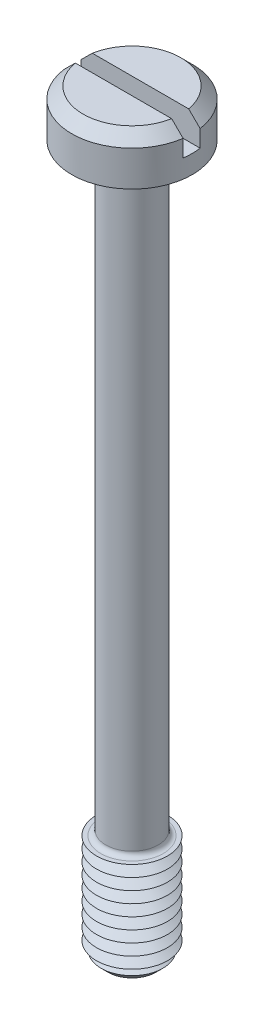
from build123d import *

# Parameters (mm, degrees)
SKETCH1_R           = 4.25
BOSS_EXTRUDE1_DEPTH = 3.3
SKETCH2_R           = 1.85
BOSS_EXTRUDE2_DEPTH = 50
SKETCH3_R           = 2.5
BOSS_EXTRUDE3_DEPTH = 7.5
CHAMFER1_SIZE       = 0.8
LPATTERN1_COUNT     = 9
LPATTERN1_PITCH     = 0.8
FILLET1_R           = 0.35
CHAMFER2_SIZE       = 0.8
SKETCH6_W           = 8.5
SKETCH6_H           = 1.2
CUT_EXTRUDE1_DEPTH  = 2


with BuildPart() as part:
    # Sketch1 → Boss-Extrude1 (new body)
    with BuildSketch(Plane(origin=(0, 0, 0), x_dir=(1, 0, 0), z_dir=(0, 1, 0))):
        with Locations(Location((0, 0, 0), (0, 0, 270))):
            Circle(SKETCH1_R)
    extrude(amount=BOSS_EXTRUDE1_DEPTH)

    # Sketch2 → Boss-Extrude2 (add)
    with BuildSketch(Plane.XZ):
        with Locations(Location((0, 0, 0), (0, 0, 270))):
            Circle(SKETCH2_R)
    extrude(amount=BOSS_EXTRUDE2_DEPTH)

    # Sketch3 → Boss-Extrude3 (add)
    with BuildSketch(Plane.XZ.offset(50)):
        with Locations(Location((0, 0, 0), (0, 0, 270))):
            Circle(SKETCH3_R)
    extrude(amount=-BOSS_EXTRUDE3_DEPTH)

    # Chamfer1
    chamfer1_edges = [part.edges().sort_by_distance(p)[0] for p in [
        (0, -50, 2.5),
    ]]
    chamfer(chamfer1_edges, length=CHAMFER1_SIZE)

    # Sketch5 → Cut-Revolve1 (revolve, cut)
    with BuildSketch(Plane(origin=(0, 0, 0), x_dir=(0, 0, -1), z_dir=(1, 0, 0))):
        Polygon((-2.5, -42.5), (-1.807179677, -42.9), (-2.5, -43.3), align=None)
    cut_revolve1 = revolve(axis=Axis((0, -6.58711856, 0), (0, -1, 0)), mode=Mode.SUBTRACT)

    # LPattern1: Cut-Revolve1 ×9
    with Locations(*[(0, -i * LPATTERN1_PITCH, 0) for i in range(1, LPATTERN1_COUNT)]):
        add(cut_revolve1, mode=Mode.SUBTRACT)

    # Fillet1
    fillet1_edges = [part.edges().sort_by_distance(p)[0] for p in [
        (0, 0, 1.85),
        (0, -42.5, 1.85),
    ]]
    fillet(fillet1_edges, radius=FILLET1_R)

    # Chamfer2
    chamfer2_edges = [part.edges().sort_by_distance(p)[0] for p in [
        (0, 3.3, -4.25),
    ]]
    chamfer(chamfer2_edges, length=CHAMFER2_SIZE)

    # Sketch6 → Cut-Extrude1 (cut)
    with BuildSketch(Plane(origin=(0, 3.3, 0), x_dir=(1, 0, 0), z_dir=(0, 1, 0))):
        Rectangle(SKETCH6_W, SKETCH6_H)
    extrude(amount=-CUT_EXTRUDE1_DEPTH, mode=Mode.SUBTRACT)


solid = part.part
